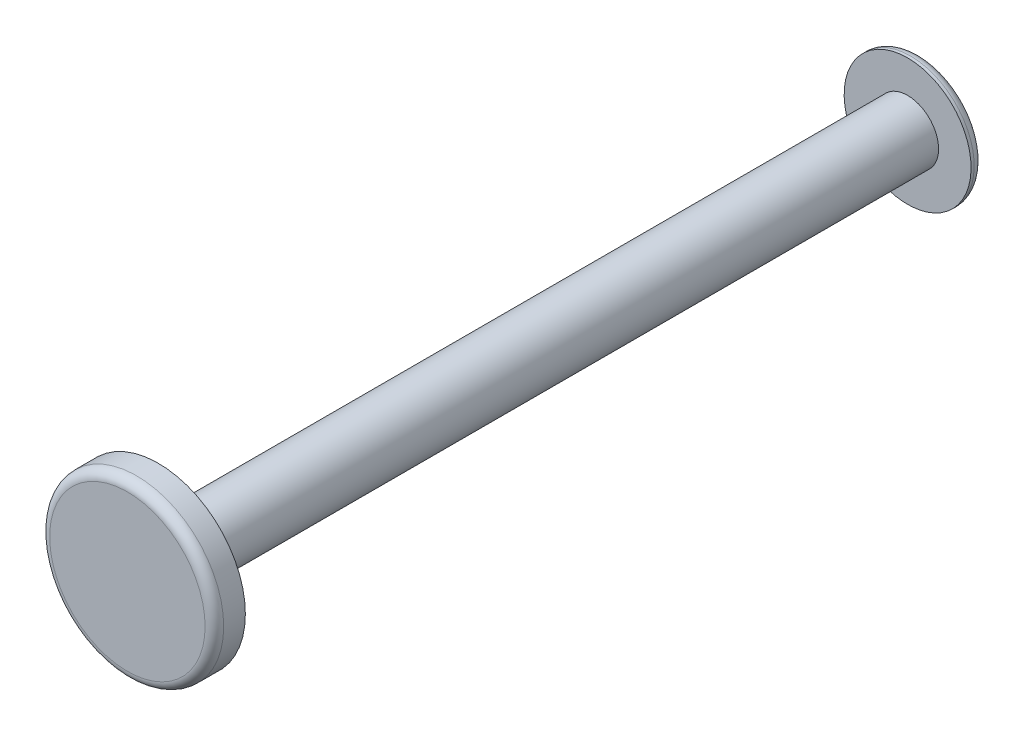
from build123d import *

# Parameters (mm, degrees)
SKETCH1_R           = 1
BASE_EXTRUDE_DEPTH  = 24.2
SKETCH2_R           = 2.81
BOSS_EXTRUDE1_DEPTH = 1
FILLET1_R           = 0.3
SKETCH3_R           = 2.05
BOSS_EXTRUDE2_DEPTH = 0.4
FILLET2_R           = 0.3


with BuildPart() as part:
    # Sketch1 → Base-Extrude (new body)
    with BuildSketch(Plane.XY):
        with Locations((0, 17.5)):
            Circle(SKETCH1_R)
    extrude(amount=-BASE_EXTRUDE_DEPTH)

    # Sketch2 → Boss-Extrude1 (add)
    with BuildSketch(Plane.XY):
        with Locations((0, 17.5)):
            Circle(SKETCH2_R)
    extrude(amount=BOSS_EXTRUDE1_DEPTH)

    # Fillet1
    fillet1_edges = [part.edges().sort_by_distance(p)[0] for p in [
        (-2.81, 17.5, 1),
    ]]
    fillet(fillet1_edges, radius=FILLET1_R)

    # Sketch3 → Boss-Extrude2 (add)
    with BuildSketch(Plane(origin=(0, 0, -24.2), x_dir=(-1, 0, 0), z_dir=(0, 0, -1))):
        with Locations(Location((0, 17.5, 0), (0, 0, 90))):
            Circle(SKETCH3_R)
    extrude(amount=BOSS_EXTRUDE2_DEPTH)

    # Sketch4 → Cut-Revolve1 (revolve, cut)
    with BuildSketch(Plane(origin=(0, 0, -24.6), x_dir=(-1, 0, 0), z_dir=(0, 0, -1))):
        with BuildLine():
            Line((0.918394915, 17.104335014), (-0.918394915, 17.895664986))
            ThreePointArc((-0.918394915, 17.895664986), (-0.395664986, 16.581605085), (0.918394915, 17.104335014))
        make_face()
    revolve(axis=Axis((0.918394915, 17.895664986, -24.6), (-0.9183949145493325, -0.39566498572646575, 0)), mode=Mode.SUBTRACT)

    # Fillet2
    fillet2_edges = [part.edges().sort_by_distance(p)[0] for p in [
        (0, 15.45, -24.6),
    ]]
    fillet(fillet2_edges, radius=FILLET2_R)


solid = part.part
